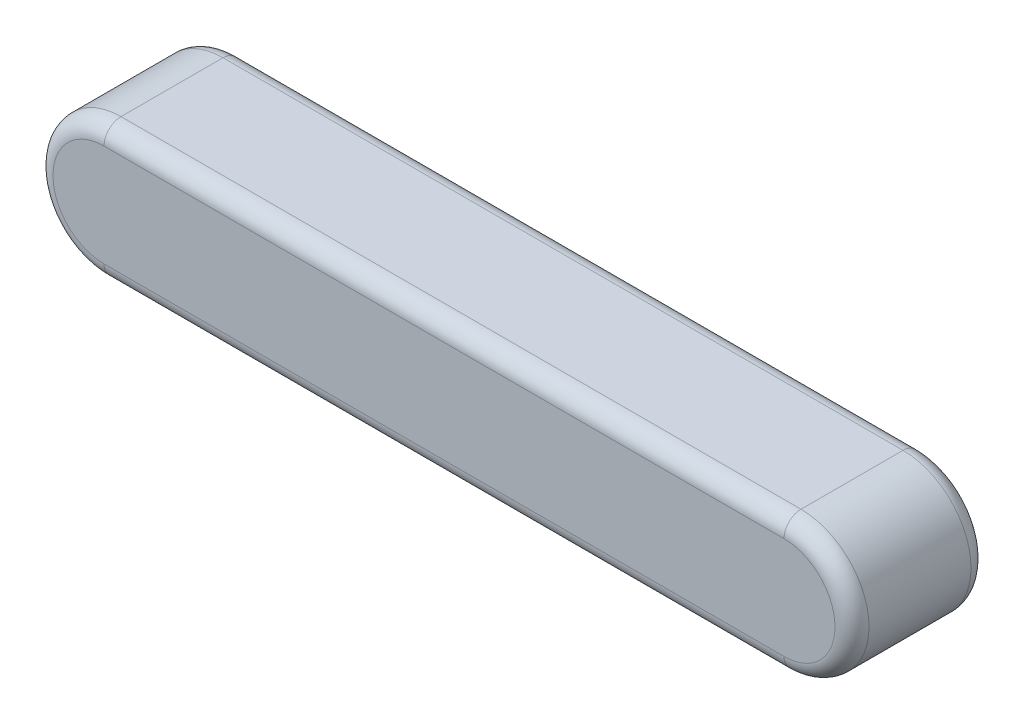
from build123d import *

# Parameters (mm, degrees)
EXTRUDE_524_DEPTH = 2
FILLET_1_R        = 0.25


with BuildPart() as part:
    # Sketch 1 → Extrude 524 (new body)
    with BuildSketch(Plane.XY):
        with BuildLine():
            Line((-5, 1), (5, 1))
            ThreePointArc((5, 1), (6, 0), (5, -1))
            Line((5, -1), (-5, -1))
            ThreePointArc((-5, -1), (-6, 0), (-5, 1))
        make_face()
    extrude(amount=EXTRUDE_524_DEPTH)

    # Fillet 1
    fillet_1_edges = [part.edges().sort_by_distance(p)[0] for p in [
        (6, 0, 2),
        (0, 1, 2),
        (-6, 0, 2),
        (0, 1, 0),
        (6, 0, 0),
        (0, -1, 0),
        (-6, 0, 0),
        (0, -1, 2),
    ]]
    fillet(fillet_1_edges, radius=FILLET_1_R)


solid = part.part
